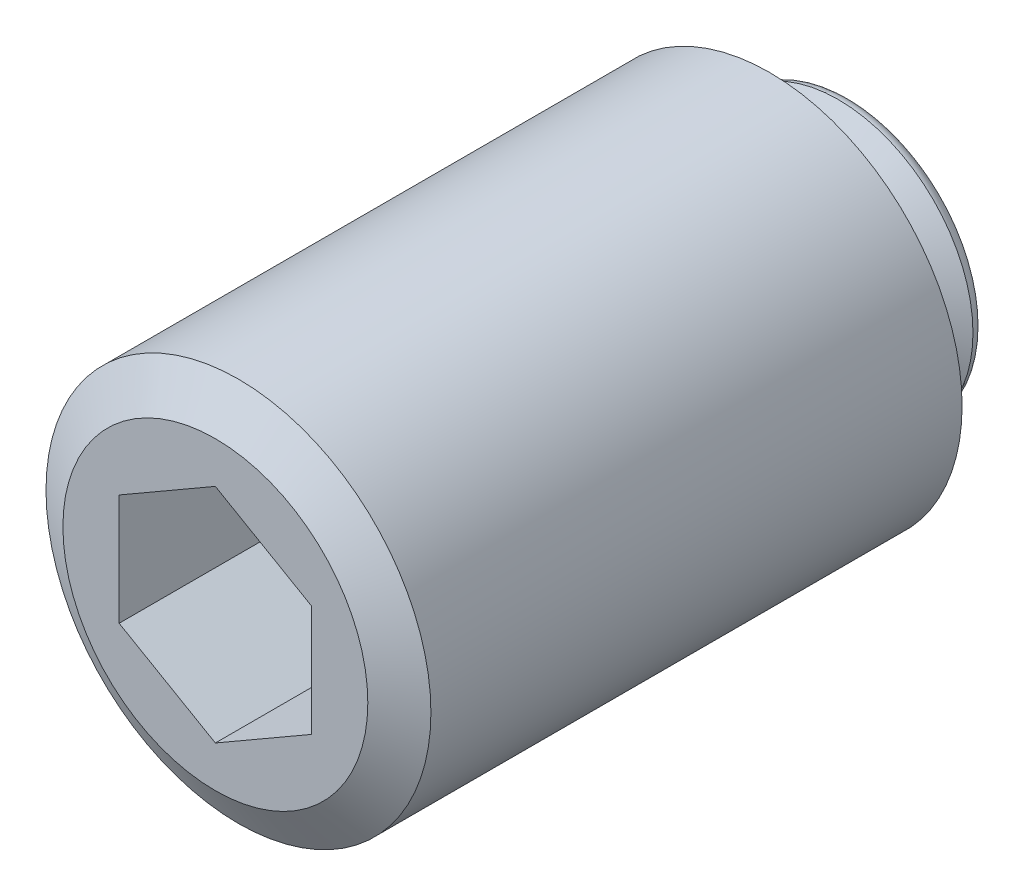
ISO-10303-21;
HEADER;
FILE_DESCRIPTION(('STEP AP214'),'2;1');
FILE_NAME('part.step','',(''),(''),'','','');
FILE_SCHEMA(('AUTOMOTIVE_DESIGN { 1 0 10303 214 1 1 1 1 }'));
ENDSEC;
DATA;
#1=APPLICATION_CONTEXT('core data for automotive mechanical design processes');
#2=APPLICATION_PROTOCOL_DEFINITION('international standard','automotive_design',2000,#1);
#3=PRODUCT_CONTEXT('',#1,'mechanical');
#4=PRODUCT('Part','Part','',(#3));
#5=PRODUCT_RELATED_PRODUCT_CATEGORY('part','',(#4));
#6=PRODUCT_DEFINITION_FORMATION('','',#4);
#7=PRODUCT_DEFINITION_CONTEXT('part definition',#1,'design');
#8=PRODUCT_DEFINITION('design','',#6,#7);
#9=PRODUCT_DEFINITION_SHAPE('','',#8);
#10=(LENGTH_UNIT() NAMED_UNIT(*) SI_UNIT(.MILLI.,.METRE.));
#11=(NAMED_UNIT(*) PLANE_ANGLE_UNIT() SI_UNIT($,.RADIAN.));
#12=(NAMED_UNIT(*) SI_UNIT($,.STERADIAN.) SOLID_ANGLE_UNIT());
#13=UNCERTAINTY_MEASURE_WITH_UNIT(LENGTH_MEASURE(1.E-05),#10,'distance_accuracy_value','');
#14=(GEOMETRIC_REPRESENTATION_CONTEXT(3) GLOBAL_UNCERTAINTY_ASSIGNED_CONTEXT((#13)) GLOBAL_UNIT_ASSIGNED_CONTEXT((#10,
#11,#12)) REPRESENTATION_CONTEXT('',''));
#15=CARTESIAN_POINT('',(0.,0.,0.));
#16=DIRECTION('',(0.,0.,1.));
#17=DIRECTION('',(1.,0.,0.));
#18=AXIS2_PLACEMENT_3D('',#15,#16,#17);
#19=CARTESIAN_POINT('',(0.,0.,33.0000000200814));
#20=DIRECTION('',(0.,0.,1.));
#21=DIRECTION('',(1.,0.,0.));
#22=AXIS2_PLACEMENT_3D('',#19,#20,#21);
#23=PLANE('',#22);
#24=DIRECTION('',(-0.866025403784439,0.5,0.));
#25=VECTOR('',#24,1.);
#26=CARTESIAN_POINT('',(5.,2.88675134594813,33.0000000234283));
#27=LINE('',#26,#25);
#28=CARTESIAN_POINT('',(5.,2.88675134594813,33.0000000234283));
#29=VERTEX_POINT('',#28);
#30=CARTESIAN_POINT('',(0.,5.77350269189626,33.0000000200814));
#31=VERTEX_POINT('',#30);
#32=EDGE_CURVE('E28',#29,#31,#27,.T.);
#33=ORIENTED_EDGE('',*,*,#32,.F.);
#34=DIRECTION('',(0.,1.,0.));
#35=VECTOR('',#34,1.);
#36=CARTESIAN_POINT('',(5.,-2.88675134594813,33.0000000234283));
#37=LINE('',#36,#35);
#38=CARTESIAN_POINT('',(5.,-2.88675134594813,33.0000000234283));
#39=VERTEX_POINT('',#38);
#40=EDGE_CURVE('E111',#39,#29,#37,.T.);
#41=ORIENTED_EDGE('',*,*,#40,.F.);
#42=DIRECTION('',(0.866025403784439,0.5,0.));
#43=VECTOR('',#42,1.);
#44=CARTESIAN_POINT('',(0.,-5.77350269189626,33.0000000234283));
#45=LINE('',#44,#43);
#46=CARTESIAN_POINT('',(0.,-5.77350269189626,33.0000000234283));
#47=VERTEX_POINT('',#46);
#48=EDGE_CURVE('E109',#47,#39,#45,.T.);
#49=ORIENTED_EDGE('',*,*,#48,.F.);
#50=DIRECTION('',(0.866025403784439,-0.5,0.));
#51=VECTOR('',#50,1.);
#52=CARTESIAN_POINT('',(-5.,-2.88675134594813,33.0000000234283));
#53=LINE('',#52,#51);
#54=CARTESIAN_POINT('',(-5.,-2.88675134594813,33.0000000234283));
#55=VERTEX_POINT('',#54);
#56=EDGE_CURVE('E76',#55,#47,#53,.T.);
#57=ORIENTED_EDGE('',*,*,#56,.F.);
#58=DIRECTION('',(0.,-1.,0.));
#59=VECTOR('',#58,1.);
#60=CARTESIAN_POINT('',(-5.,2.88675134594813,33.0000000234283));
#61=LINE('',#60,#59);
#62=CARTESIAN_POINT('',(-5.,2.88675134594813,33.0000000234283));
#63=VERTEX_POINT('',#62);
#64=EDGE_CURVE('E105',#63,#55,#61,.T.);
#65=ORIENTED_EDGE('',*,*,#64,.F.);
#66=DIRECTION('',(-0.866025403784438,-0.5,0.));
#67=VECTOR('',#66,1.);
#68=CARTESIAN_POINT('',(0.,5.77350269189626,33.0000000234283));
#69=LINE('',#68,#67);
#70=EDGE_CURVE('E102',#31,#63,#69,.T.);
#71=ORIENTED_EDGE('',*,*,#70,.F.);
#72=EDGE_LOOP('',(#33,#41,#49,#57,#65,#71));
#73=FACE_BOUND('',#72,.T.);
#74=CARTESIAN_POINT('',(0.,0.,33.0000000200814));
#75=DIRECTION('',(0.,0.,1.));
#76=DIRECTION('',(1.,0.,0.));
#77=AXIS2_PLACEMENT_3D('',#74,#75,#76);
#78=CIRCLE('',#77,7.92153900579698);
#79=CARTESIAN_POINT('',(7.92153900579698,0.,33.0000000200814));
#80=VERTEX_POINT('',#79);
#81=EDGE_CURVE('E9',#80,#80,#78,.T.);
#82=ORIENTED_EDGE('',*,*,#81,.T.);
#83=EDGE_LOOP('',(#82));
#84=FACE_BOUND('',#83,.T.);
#85=ADVANCED_FACE('F14',(#73,#84),#23,.T.);
#86=CARTESIAN_POINT('',(0.,0.,33.0000000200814));
#87=DIRECTION('',(0.,0.,-1.));
#88=DIRECTION('',(-1.,0.,0.));
#89=AXIS2_PLACEMENT_3D('',#86,#87,#88);
#90=CONICAL_SURFACE('',#89,7.92153900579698,1.0471975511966);
#91=CARTESIAN_POINT('',(0.,0.,31.8000000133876));
#92=DIRECTION('',(0.,0.,1.));
#93=DIRECTION('',(1.,0.,0.));
#94=AXIS2_PLACEMENT_3D('',#91,#92,#93);
#95=CIRCLE('',#94,9.99999998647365);
#96=CARTESIAN_POINT('',(9.99999998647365,0.,31.8000000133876));
#97=VERTEX_POINT('',#96);
#98=EDGE_CURVE('E21',#97,#97,#95,.T.);
#99=ORIENTED_EDGE('',*,*,#98,.T.);
#100=EDGE_LOOP('',(#99));
#101=FACE_BOUND('',#100,.T.);
#102=ORIENTED_EDGE('',*,*,#81,.F.);
#103=EDGE_LOOP('',(#102));
#104=FACE_BOUND('',#103,.T.);
#105=ADVANCED_FACE('F149',(#101,#104),#90,.T.);
#106=CARTESIAN_POINT('',(0.,0.,35.9999999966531));
#107=DIRECTION('',(0.,0.,1.));
#108=DIRECTION('',(1.,0.,0.));
#109=AXIS2_PLACEMENT_3D('',#106,#107,#108);
#110=CYLINDRICAL_SURFACE('',#109,9.99999998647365);
#111=CARTESIAN_POINT('',(0.,0.,4.2000000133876));
#112=DIRECTION('',(0.,0.,1.));
#113=DIRECTION('',(1.,0.,0.));
#114=AXIS2_PLACEMENT_3D('',#111,#112,#113);
#115=CIRCLE('',#114,9.99999998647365);
#116=CARTESIAN_POINT('',(9.99999998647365,0.,4.2000000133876));
#117=VERTEX_POINT('',#116);
#118=EDGE_CURVE('E144',#117,#117,#115,.T.);
#119=ORIENTED_EDGE('',*,*,#118,.T.);
#120=EDGE_LOOP('',(#119));
#121=FACE_BOUND('',#120,.T.);
#122=ORIENTED_EDGE('',*,*,#98,.F.);
#123=EDGE_LOOP('',(#122));
#124=FACE_BOUND('',#123,.T.);
#125=ADVANCED_FACE('F152',(#121,#124),#110,.T.);
#126=CARTESIAN_POINT('',(0.,0.,4.2000000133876));
#127=DIRECTION('',(0.,0.,1.));
#128=DIRECTION('',(1.,0.,0.));
#129=AXIS2_PLACEMENT_3D('',#126,#127,#128);
#130=CONICAL_SURFACE('',#129,9.99999998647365,1.0471975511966);
#131=CARTESIAN_POINT('',(0.,0.,3.));
#132=DIRECTION('',(0.,0.,1.));
#133=DIRECTION('',(1.,0.,0.));
#134=AXIS2_PLACEMENT_3D('',#131,#132,#133);
#135=CIRCLE('',#134,7.92153899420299);
#136=CARTESIAN_POINT('',(7.92153899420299,0.,3.));
#137=VERTEX_POINT('',#136);
#138=EDGE_CURVE('E141',#137,#137,#135,.T.);
#139=ORIENTED_EDGE('',*,*,#138,.T.);
#140=EDGE_LOOP('',(#139));
#141=FACE_BOUND('',#140,.T.);
#142=ORIENTED_EDGE('',*,*,#118,.F.);
#143=EDGE_LOOP('',(#142));
#144=FACE_BOUND('',#143,.T.);
#145=ADVANCED_FACE('F154',(#141,#144),#130,.T.);
#146=CARTESIAN_POINT('',(0.,5.56999083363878,3.));
#147=DIRECTION('',(0.,0.,-1.));
#148=DIRECTION('',(-1.,0.,0.));
#149=AXIS2_PLACEMENT_3D('',#146,#147,#148);
#150=PLANE('',#149);
#151=CARTESIAN_POINT('',(0.,0.,3.));
#152=DIRECTION('',(0.,0.,1.));
#153=DIRECTION('',(1.,0.,0.));
#154=AXIS2_PLACEMENT_3D('',#151,#152,#153);
#155=CIRCLE('',#154,5.56999083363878);
#156=CARTESIAN_POINT('',(5.56999083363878,0.,3.));
#157=VERTEX_POINT('',#156);
#158=EDGE_CURVE('E138',#157,#157,#155,.T.);
#159=ORIENTED_EDGE('',*,*,#158,.T.);
#160=EDGE_LOOP('',(#159));
#161=FACE_BOUND('',#160,.T.);
#162=ORIENTED_EDGE('',*,*,#138,.F.);
#163=EDGE_LOOP('',(#162));
#164=FACE_BOUND('',#163,.T.);
#165=ADVANCED_FACE('F163',(#161,#164),#150,.T.);
#166=CARTESIAN_POINT('',(0.,0.,3.));
#167=DIRECTION('',(0.,0.,1.));
#168=DIRECTION('',(1.,0.,0.));
#169=AXIS2_PLACEMENT_3D('',#166,#167,#168);
#170=CONICAL_SURFACE('',#169,5.56999083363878,0.551775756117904);
#171=CARTESIAN_POINT('',(0.,0.,2.8864159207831));
#172=DIRECTION('',(0.,0.,1.));
#173=DIRECTION('',(1.,0.,0.));
#174=AXIS2_PLACEMENT_3D('',#171,#172,#173);
#175=CIRCLE('',#174,5.50007402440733);
#176=CARTESIAN_POINT('',(5.50007402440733,0.,2.8864159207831));
#177=VERTEX_POINT('',#176);
#178=EDGE_CURVE('E135',#177,#177,#175,.T.);
#179=ORIENTED_EDGE('',*,*,#178,.T.);
#180=EDGE_LOOP('',(#179));
#181=FACE_BOUND('',#180,.T.);
#182=ORIENTED_EDGE('',*,*,#158,.F.);
#183=EDGE_LOOP('',(#182));
#184=FACE_BOUND('',#183,.T.);
#185=ADVANCED_FACE('F214',(#181,#184),#170,.T.);
#186=CARTESIAN_POINT('',(0.,0.,2.75105408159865));
#187=DIRECTION('',(0.,0.,1.));
#188=DIRECTION('',(1.,0.,0.));
#189=AXIS2_PLACEMENT_3D('',#186,#187,#188);
#190=TOROIDAL_SURFACE('',#189,5.71499999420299,0.254000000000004);
#191=CARTESIAN_POINT('',(0.,0.,2.75105408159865));
#192=DIRECTION('',(0.,0.,1.));
#193=DIRECTION('',(1.,0.,0.));
#194=AXIS2_PLACEMENT_3D('',#191,#192,#193);
#195=CIRCLE('',#194,5.460999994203);
#196=CARTESIAN_POINT('',(5.460999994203,0.,2.75105408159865));
#197=VERTEX_POINT('',#196);
#198=EDGE_CURVE('E132',#197,#197,#195,.T.);
#199=ORIENTED_EDGE('',*,*,#198,.T.);
#200=EDGE_LOOP('',(#199));
#201=FACE_BOUND('',#200,.T.);
#202=ORIENTED_EDGE('',*,*,#178,.F.);
#203=EDGE_LOOP('',(#202));
#204=FACE_BOUND('',#203,.T.);
#205=ADVANCED_FACE('F210',(#201,#204),#190,.F.);
#206=CARTESIAN_POINT('',(0.,0.,35.9999999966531));
#207=DIRECTION('',(0.,0.,1.));
#208=DIRECTION('',(1.,0.,0.));
#209=AXIS2_PLACEMENT_3D('',#206,#207,#208);
#210=CYLINDRICAL_SURFACE('',#209,5.46099999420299);
#211=CARTESIAN_POINT('',(0.,0.,1.67018903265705));
#212=DIRECTION('',(0.,0.,1.));
#213=DIRECTION('',(1.,0.,0.));
#214=AXIS2_PLACEMENT_3D('',#211,#212,#213);
#215=CIRCLE('',#214,5.46099999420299);
#216=CARTESIAN_POINT('',(5.46099999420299,0.,1.67018903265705));
#217=VERTEX_POINT('',#216);
#218=EDGE_CURVE('E129',#217,#217,#215,.T.);
#219=ORIENTED_EDGE('',*,*,#218,.T.);
#220=EDGE_LOOP('',(#219));
#221=FACE_BOUND('',#220,.T.);
#222=ORIENTED_EDGE('',*,*,#198,.F.);
#223=EDGE_LOOP('',(#222));
#224=FACE_BOUND('',#223,.T.);
#225=ADVANCED_FACE('F206',(#221,#224),#210,.T.);
#226=CARTESIAN_POINT('',(0.,0.,1.67018903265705));
#227=DIRECTION('',(0.,0.,1.));
#228=DIRECTION('',(1.,0.,0.));
#229=AXIS2_PLACEMENT_3D('',#226,#227,#228);
#230=TOROIDAL_SURFACE('',#229,5.71499999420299,0.254000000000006);
#231=CARTESIAN_POINT('',(0.,0.,1.45021858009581));
#232=DIRECTION('',(0.,0.,1.));
#233=DIRECTION('',(1.,0.,0.));
#234=AXIS2_PLACEMENT_3D('',#231,#232,#233);
#235=CIRCLE('',#234,5.58799999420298);
#236=CARTESIAN_POINT('',(5.58799999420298,0.,1.45021858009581));
#237=VERTEX_POINT('',#236);
#238=EDGE_CURVE('E126',#237,#237,#235,.T.);
#239=ORIENTED_EDGE('',*,*,#238,.T.);
#240=EDGE_LOOP('',(#239));
#241=FACE_BOUND('',#240,.T.);
#242=ORIENTED_EDGE('',*,*,#218,.F.);
#243=EDGE_LOOP('',(#242));
#244=FACE_BOUND('',#243,.T.);
#245=ADVANCED_FACE('F202',(#241,#244),#230,.F.);
#246=CARTESIAN_POINT('',(0.,0.,1.45021858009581));
#247=DIRECTION('',(0.,0.,-1.));
#248=DIRECTION('',(-1.,0.,0.));
#249=AXIS2_PLACEMENT_3D('',#246,#247,#248);
#250=CONICAL_SURFACE('',#249,5.58799999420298,1.04719755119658);
#251=CARTESIAN_POINT('',(0.,0.,0.635));
#252=DIRECTION('',(0.,0.,1.));
#253=DIRECTION('',(1.,0.,0.));
#254=AXIS2_PLACEMENT_3D('',#251,#252,#253);
#255=CIRCLE('',#254,6.99999999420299);
#256=CARTESIAN_POINT('',(6.99999999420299,0.,0.635));
#257=VERTEX_POINT('',#256);
#258=EDGE_CURVE('E123',#257,#257,#255,.T.);
#259=ORIENTED_EDGE('',*,*,#258,.T.);
#260=EDGE_LOOP('',(#259));
#261=FACE_BOUND('',#260,.T.);
#262=ORIENTED_EDGE('',*,*,#238,.F.);
#263=EDGE_LOOP('',(#262));
#264=FACE_BOUND('',#263,.T.);
#265=ADVANCED_FACE('F198',(#261,#264),#250,.T.);
#266=CARTESIAN_POINT('',(0.,0.,0.635));
#267=DIRECTION('',(0.,0.,1.));
#268=DIRECTION('',(1.,0.,0.));
#269=AXIS2_PLACEMENT_3D('',#266,#267,#268);
#270=TOROIDAL_SURFACE('',#269,6.36499999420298,0.635000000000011);
#271=CARTESIAN_POINT('',(0.,0.,0.));
#272=DIRECTION('',(0.,0.,1.));
#273=DIRECTION('',(1.,0.,0.));
#274=AXIS2_PLACEMENT_3D('',#271,#272,#273);
#275=CIRCLE('',#274,6.36500000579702);
#276=CARTESIAN_POINT('',(6.36500000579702,0.,0.));
#277=VERTEX_POINT('',#276);
#278=EDGE_CURVE('E115',#277,#277,#275,.T.);
#279=ORIENTED_EDGE('',*,*,#278,.T.);
#280=EDGE_LOOP('',(#279));
#281=FACE_BOUND('',#280,.T.);
#282=ORIENTED_EDGE('',*,*,#258,.F.);
#283=EDGE_LOOP('',(#282));
#284=FACE_BOUND('',#283,.T.);
#285=ADVANCED_FACE('F190',(#281,#284),#270,.T.);
#286=CARTESIAN_POINT('',(0.,0.,0.));
#287=DIRECTION('',(0.,0.,-1.));
#288=DIRECTION('',(-1.,0.,0.));
#289=AXIS2_PLACEMENT_3D('',#286,#287,#288);
#290=PLANE('',#289);
#291=ORIENTED_EDGE('',*,*,#278,.F.);
#292=EDGE_LOOP('',(#291));
#293=FACE_BOUND('',#292,.T.);
#294=ADVANCED_FACE('F182',(#293),#290,.T.);
#295=CARTESIAN_POINT('',(5.,2.88675134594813,25.0000000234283));
#296=DIRECTION('',(0.5,0.866025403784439,0.));
#297=DIRECTION('',(0.866025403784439,-0.5,0.));
#298=AXIS2_PLACEMENT_3D('',#295,#296,#297);
#299=PLANE('',#298);
#300=ORIENTED_EDGE('',*,*,#32,.T.);
#301=DIRECTION('',(0.,0.,1.));
#302=VECTOR('',#301,1.);
#303=CARTESIAN_POINT('',(0.,5.77350269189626,25.0000000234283));
#304=LINE('',#303,#302);
#305=CARTESIAN_POINT('',(0.,5.77350269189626,25.0000000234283));
#306=VERTEX_POINT('',#305);
#307=EDGE_CURVE('E58',#306,#31,#304,.T.);
#308=ORIENTED_EDGE('',*,*,#307,.F.);
#309=DIRECTION('',(-0.866025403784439,0.5,0.));
#310=VECTOR('',#309,1.);
#311=CARTESIAN_POINT('',(5.,2.88675134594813,25.0000000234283));
#312=LINE('',#311,#310);
#313=CARTESIAN_POINT('',(5.,2.88675134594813,25.0000000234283));
#314=VERTEX_POINT('',#313);
#315=EDGE_CURVE('E113',#314,#306,#312,.T.);
#316=ORIENTED_EDGE('',*,*,#315,.F.);
#317=DIRECTION('',(0.,0.,1.));
#318=VECTOR('',#317,1.);
#319=CARTESIAN_POINT('',(5.,2.88675134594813,25.0000000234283));
#320=LINE('',#319,#318);
#321=EDGE_CURVE('E36',#314,#29,#320,.T.);
#322=ORIENTED_EDGE('',*,*,#321,.T.);
#323=EDGE_LOOP('',(#300,#308,#316,#322));
#324=FACE_BOUND('',#323,.T.);
#325=ADVANCED_FACE('F179',(#324),#299,.F.);
#326=CARTESIAN_POINT('',(5.,-2.88675134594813,25.0000000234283));
#327=DIRECTION('',(1.,0.,0.));
#328=DIRECTION('',(0.,0.,-1.));
#329=AXIS2_PLACEMENT_3D('',#326,#327,#328);
#330=PLANE('',#329);
#331=ORIENTED_EDGE('',*,*,#40,.T.);
#332=ORIENTED_EDGE('',*,*,#321,.F.);
#333=DIRECTION('',(0.,1.,0.));
#334=VECTOR('',#333,1.);
#335=CARTESIAN_POINT('',(5.,-2.88675134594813,25.0000000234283));
#336=LINE('',#335,#334);
#337=CARTESIAN_POINT('',(5.,-2.88675134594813,25.0000000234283));
#338=VERTEX_POINT('',#337);
#339=EDGE_CURVE('E88',#338,#314,#336,.T.);
#340=ORIENTED_EDGE('',*,*,#339,.F.);
#341=DIRECTION('',(0.,0.,1.));
#342=VECTOR('',#341,1.);
#343=CARTESIAN_POINT('',(5.,-2.88675134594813,25.0000000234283));
#344=LINE('',#343,#342);
#345=EDGE_CURVE('E80',#338,#39,#344,.T.);
#346=ORIENTED_EDGE('',*,*,#345,.T.);
#347=EDGE_LOOP('',(#331,#332,#340,#346));
#348=FACE_BOUND('',#347,.T.);
#349=ADVANCED_FACE('F181',(#348),#330,.F.);
#350=CARTESIAN_POINT('',(0.,-5.77350269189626,25.0000000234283));
#351=DIRECTION('',(0.5,-0.866025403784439,0.));
#352=DIRECTION('',(-0.866025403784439,-0.5,0.));
#353=AXIS2_PLACEMENT_3D('',#350,#351,#352);
#354=PLANE('',#353);
#355=ORIENTED_EDGE('',*,*,#48,.T.);
#356=ORIENTED_EDGE('',*,*,#345,.F.);
#357=DIRECTION('',(0.866025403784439,0.5,0.));
#358=VECTOR('',#357,1.);
#359=CARTESIAN_POINT('',(0.,-5.77350269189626,25.0000000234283));
#360=LINE('',#359,#358);
#361=CARTESIAN_POINT('',(0.,-5.77350269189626,25.0000000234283));
#362=VERTEX_POINT('',#361);
#363=EDGE_CURVE('E84',#362,#338,#360,.T.);
#364=ORIENTED_EDGE('',*,*,#363,.F.);
#365=DIRECTION('',(0.,0.,1.));
#366=VECTOR('',#365,1.);
#367=CARTESIAN_POINT('',(0.,-5.77350269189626,25.0000000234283));
#368=LINE('',#367,#366);
#369=EDGE_CURVE('E69',#362,#47,#368,.T.);
#370=ORIENTED_EDGE('',*,*,#369,.T.);
#371=EDGE_LOOP('',(#355,#356,#364,#370));
#372=FACE_BOUND('',#371,.T.);
#373=ADVANCED_FACE('F85',(#372),#354,.F.);
#374=CARTESIAN_POINT('',(-5.,-2.88675134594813,25.0000000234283));
#375=DIRECTION('',(-0.5,-0.866025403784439,0.));
#376=DIRECTION('',(-0.866025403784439,0.5,0.));
#377=AXIS2_PLACEMENT_3D('',#374,#375,#376);
#378=PLANE('',#377);
#379=ORIENTED_EDGE('',*,*,#56,.T.);
#380=ORIENTED_EDGE('',*,*,#369,.F.);
#381=DIRECTION('',(0.866025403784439,-0.5,0.));
#382=VECTOR('',#381,1.);
#383=CARTESIAN_POINT('',(-5.,-2.88675134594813,25.0000000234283));
#384=LINE('',#383,#382);
#385=CARTESIAN_POINT('',(-5.,-2.88675134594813,25.0000000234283));
#386=VERTEX_POINT('',#385);
#387=EDGE_CURVE('E73',#386,#362,#384,.T.);
#388=ORIENTED_EDGE('',*,*,#387,.F.);
#389=DIRECTION('',(0.,0.,1.));
#390=VECTOR('',#389,1.);
#391=CARTESIAN_POINT('',(-5.,-2.88675134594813,25.0000000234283));
#392=LINE('',#391,#390);
#393=EDGE_CURVE('E81',#386,#55,#392,.T.);
#394=ORIENTED_EDGE('',*,*,#393,.T.);
#395=EDGE_LOOP('',(#379,#380,#388,#394));
#396=FACE_BOUND('',#395,.T.);
#397=ADVANCED_FACE('F71',(#396),#378,.F.);
#398=CARTESIAN_POINT('',(-5.,2.88675134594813,25.0000000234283));
#399=DIRECTION('',(-1.,0.,0.));
#400=DIRECTION('',(0.,0.,1.));
#401=AXIS2_PLACEMENT_3D('',#398,#399,#400);
#402=PLANE('',#401);
#403=ORIENTED_EDGE('',*,*,#64,.T.);
#404=ORIENTED_EDGE('',*,*,#393,.F.);
#405=DIRECTION('',(0.,-1.,0.));
#406=VECTOR('',#405,1.);
#407=CARTESIAN_POINT('',(-5.,2.88675134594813,25.0000000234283));
#408=LINE('',#407,#406);
#409=CARTESIAN_POINT('',(-5.,2.88675134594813,25.0000000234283));
#410=VERTEX_POINT('',#409);
#411=EDGE_CURVE('E94',#410,#386,#408,.T.);
#412=ORIENTED_EDGE('',*,*,#411,.F.);
#413=DIRECTION('',(0.,0.,1.));
#414=VECTOR('',#413,1.);
#415=CARTESIAN_POINT('',(-5.,2.88675134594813,25.0000000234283));
#416=LINE('',#415,#414);
#417=EDGE_CURVE('E118',#410,#63,#416,.T.);
#418=ORIENTED_EDGE('',*,*,#417,.T.);
#419=EDGE_LOOP('',(#403,#404,#412,#418));
#420=FACE_BOUND('',#419,.T.);
#421=ADVANCED_FACE('F321',(#420),#402,.F.);
#422=CARTESIAN_POINT('',(0.,5.77350269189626,25.0000000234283));
#423=DIRECTION('',(-0.5,0.866025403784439,0.));
#424=DIRECTION('',(0.866025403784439,0.5,0.));
#425=AXIS2_PLACEMENT_3D('',#422,#423,#424);
#426=PLANE('',#425);
#427=ORIENTED_EDGE('',*,*,#70,.T.);
#428=ORIENTED_EDGE('',*,*,#417,.F.);
#429=DIRECTION('',(-0.866025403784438,-0.5,0.));
#430=VECTOR('',#429,1.);
#431=CARTESIAN_POINT('',(0.,5.77350269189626,25.0000000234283));
#432=LINE('',#431,#430);
#433=EDGE_CURVE('E96',#306,#410,#432,.T.);
#434=ORIENTED_EDGE('',*,*,#433,.F.);
#435=ORIENTED_EDGE('',*,*,#307,.T.);
#436=EDGE_LOOP('',(#427,#428,#434,#435));
#437=FACE_BOUND('',#436,.T.);
#438=ADVANCED_FACE('F177',(#437),#426,.F.);
#439=CARTESIAN_POINT('',(0.,5.77350269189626,25.0000000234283));
#440=DIRECTION('',(0.,0.,1.));
#441=DIRECTION('',(1.,0.,0.));
#442=AXIS2_PLACEMENT_3D('',#439,#440,#441);
#443=PLANE('',#442);
#444=ORIENTED_EDGE('',*,*,#315,.T.);
#445=ORIENTED_EDGE('',*,*,#433,.T.);
#446=ORIENTED_EDGE('',*,*,#411,.T.);
#447=ORIENTED_EDGE('',*,*,#387,.T.);
#448=ORIENTED_EDGE('',*,*,#363,.T.);
#449=ORIENTED_EDGE('',*,*,#339,.T.);
#450=EDGE_LOOP('',(#444,#445,#446,#447,#448,#449));
#451=FACE_BOUND('',#450,.T.);
#452=ADVANCED_FACE('F91',(#451),#443,.T.);
#453=CLOSED_SHELL('',(#85,#105,#125,#145,#165,#185,#205,#225,#245,#265,#285,#294,#325,#349,#373,
#397,#421,#438,#452));
#454=MANIFOLD_SOLID_BREP('B1',#453);
#455=ADVANCED_BREP_SHAPE_REPRESENTATION('',(#18,#454),#14);
#456=SHAPE_DEFINITION_REPRESENTATION(#9,#455);
ENDSEC;
END-ISO-10303-21;
